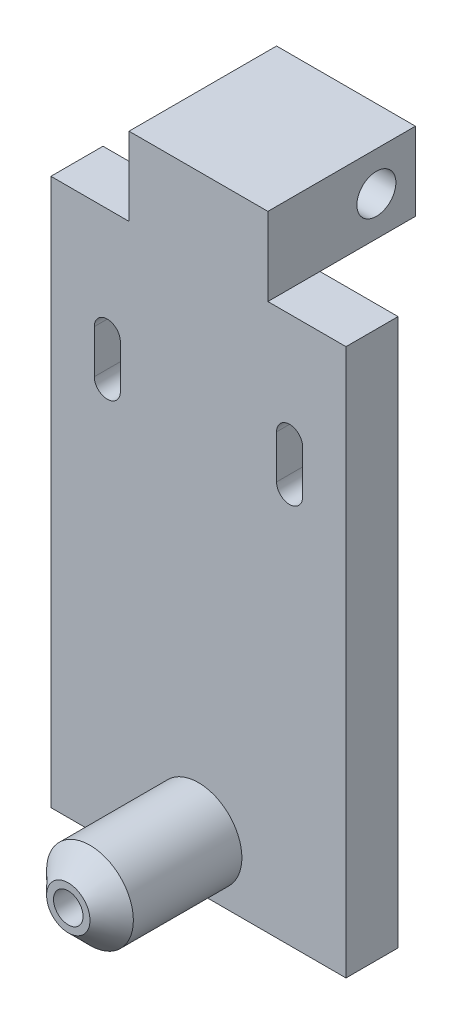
ISO-10303-21;
HEADER;
FILE_DESCRIPTION(('STEP AP214'),'2;1');
FILE_NAME('part.step','',(''),(''),'','','');
FILE_SCHEMA(('AUTOMOTIVE_DESIGN { 1 0 10303 214 1 1 1 1 }'));
ENDSEC;
DATA;
#1=APPLICATION_CONTEXT('core data for automotive mechanical design processes');
#2=APPLICATION_PROTOCOL_DEFINITION('international standard','automotive_design',2000,#1);
#3=PRODUCT_CONTEXT('',#1,'mechanical');
#4=PRODUCT('Part','Part','',(#3));
#5=PRODUCT_RELATED_PRODUCT_CATEGORY('part','',(#4));
#6=PRODUCT_DEFINITION_FORMATION('','',#4);
#7=PRODUCT_DEFINITION_CONTEXT('part definition',#1,'design');
#8=PRODUCT_DEFINITION('design','',#6,#7);
#9=PRODUCT_DEFINITION_SHAPE('','',#8);
#10=(LENGTH_UNIT() NAMED_UNIT(*) SI_UNIT(.MILLI.,.METRE.));
#11=(NAMED_UNIT(*) PLANE_ANGLE_UNIT() SI_UNIT($,.RADIAN.));
#12=(NAMED_UNIT(*) SI_UNIT($,.STERADIAN.) SOLID_ANGLE_UNIT());
#13=UNCERTAINTY_MEASURE_WITH_UNIT(LENGTH_MEASURE(1.E-05),#10,'distance_accuracy_value','');
#14=(GEOMETRIC_REPRESENTATION_CONTEXT(3) GLOBAL_UNCERTAINTY_ASSIGNED_CONTEXT((#13)) GLOBAL_UNIT_ASSIGNED_CONTEXT((#10,
#11,#12)) REPRESENTATION_CONTEXT('',''));
#15=CARTESIAN_POINT('',(0.,0.,0.));
#16=DIRECTION('',(0.,0.,1.));
#17=DIRECTION('',(1.,0.,0.));
#18=AXIS2_PLACEMENT_3D('',#15,#16,#17);
#19=CARTESIAN_POINT('',(0.,126.,12.));
#20=DIRECTION('',(0.,-1.,0.));
#21=DIRECTION('',(0.,0.,-1.));
#22=AXIS2_PLACEMENT_3D('',#19,#20,#21);
#23=PLANE('',#22);
#24=DIRECTION('',(0.,0.,1.));
#25=VECTOR('',#24,1.);
#26=CARTESIAN_POINT('',(18.,126.,12.));
#27=LINE('',#26,#25);
#28=CARTESIAN_POINT('',(18.,126.,0.));
#29=VERTEX_POINT('',#28);
#30=CARTESIAN_POINT('',(18.,126.,12.));
#31=VERTEX_POINT('',#30);
#32=EDGE_CURVE('E224',#29,#31,#27,.T.);
#33=ORIENTED_EDGE('',*,*,#32,.F.);
#34=DIRECTION('',(-1.,0.,0.));
#35=VECTOR('',#34,1.);
#36=CARTESIAN_POINT('',(0.,126.,0.));
#37=LINE('',#36,#35);
#38=CARTESIAN_POINT('',(0.,126.,0.));
#39=VERTEX_POINT('',#38);
#40=EDGE_CURVE('E329',#29,#39,#37,.T.);
#41=ORIENTED_EDGE('',*,*,#40,.T.);
#42=DIRECTION('',(0.,0.,-1.));
#43=VECTOR('',#42,1.);
#44=CARTESIAN_POINT('',(0.,126.,12.));
#45=LINE('',#44,#43);
#46=CARTESIAN_POINT('',(0.,126.,12.));
#47=VERTEX_POINT('',#46);
#48=EDGE_CURVE('E315',#47,#39,#45,.T.);
#49=ORIENTED_EDGE('',*,*,#48,.F.);
#50=DIRECTION('',(-1.,0.,0.));
#51=VECTOR('',#50,1.);
#52=CARTESIAN_POINT('',(0.,126.,12.));
#53=LINE('',#52,#51);
#54=EDGE_CURVE('E230',#31,#47,#53,.T.);
#55=ORIENTED_EDGE('',*,*,#54,.F.);
#56=EDGE_LOOP('',(#33,#41,#49,#55));
#57=FACE_BOUND('',#56,.T.);
#58=ADVANCED_FACE('F32',(#57),#23,.F.);
#59=DIRECTION('',(0.,0.,-1.));
#60=VECTOR('',#59,1.);
#61=CARTESIAN_POINT('',(50.,126.,12.));
#62=LINE('',#61,#60);
#63=CARTESIAN_POINT('',(50.,126.,12.));
#64=VERTEX_POINT('',#63);
#65=CARTESIAN_POINT('',(50.,126.,0.));
#66=VERTEX_POINT('',#65);
#67=EDGE_CURVE('E233',#64,#66,#62,.T.);
#68=ORIENTED_EDGE('',*,*,#67,.F.);
#69=CARTESIAN_POINT('',(68.,126.,12.));
#70=VERTEX_POINT('',#69);
#71=EDGE_CURVE('E336',#70,#64,#53,.T.);
#72=ORIENTED_EDGE('',*,*,#71,.F.);
#73=DIRECTION('',(0.,0.,-1.));
#74=VECTOR('',#73,1.);
#75=CARTESIAN_POINT('',(68.,126.,12.));
#76=LINE('',#75,#74);
#77=CARTESIAN_POINT('',(68.,126.,0.));
#78=VERTEX_POINT('',#77);
#79=EDGE_CURVE('E335',#70,#78,#76,.T.);
#80=ORIENTED_EDGE('',*,*,#79,.T.);
#81=EDGE_CURVE('E330',#78,#66,#37,.T.);
#82=ORIENTED_EDGE('',*,*,#81,.T.);
#83=EDGE_LOOP('',(#68,#72,#80,#82));
#84=FACE_BOUND('',#83,.T.);
#85=ADVANCED_FACE('F283',(#84),#23,.F.);
#86=CARTESIAN_POINT('',(0.,126.,12.));
#87=DIRECTION('',(0.,0.,-1.));
#88=DIRECTION('',(-1.,0.,0.));
#89=AXIS2_PLACEMENT_3D('',#86,#87,#88);
#90=PLANE('',#89);
#91=DIRECTION('',(0.,-1.,0.));
#92=VECTOR('',#91,1.);
#93=CARTESIAN_POINT('',(52.,101.,12.));
#94=LINE('',#93,#92);
#95=CARTESIAN_POINT('',(52.,101.,12.));
#96=VERTEX_POINT('',#95);
#97=CARTESIAN_POINT('',(52.,91.,12.));
#98=VERTEX_POINT('',#97);
#99=EDGE_CURVE('E165',#96,#98,#94,.T.);
#100=ORIENTED_EDGE('',*,*,#99,.F.);
#101=CARTESIAN_POINT('',(55.,101.,12.));
#102=DIRECTION('',(0.,0.,1.));
#103=DIRECTION('',(-1.,0.,0.));
#104=AXIS2_PLACEMENT_3D('',#101,#102,#103);
#105=CIRCLE('',#104,3.);
#106=CARTESIAN_POINT('',(58.,101.,12.));
#107=VERTEX_POINT('',#106);
#108=EDGE_CURVE('E47',#107,#96,#105,.T.);
#109=ORIENTED_EDGE('',*,*,#108,.F.);
#110=DIRECTION('',(0.,1.,0.));
#111=VECTOR('',#110,1.);
#112=CARTESIAN_POINT('',(58.,101.,12.));
#113=LINE('',#112,#111);
#114=CARTESIAN_POINT('',(58.,91.,12.));
#115=VERTEX_POINT('',#114);
#116=EDGE_CURVE('E172',#115,#107,#113,.T.);
#117=ORIENTED_EDGE('',*,*,#116,.F.);
#118=CARTESIAN_POINT('',(55.,91.,12.));
#119=DIRECTION('',(0.,0.,1.));
#120=DIRECTION('',(1.,0.,0.));
#121=AXIS2_PLACEMENT_3D('',#118,#119,#120);
#122=CIRCLE('',#121,3.);
#123=EDGE_CURVE('E156',#98,#115,#122,.T.);
#124=ORIENTED_EDGE('',*,*,#123,.F.);
#125=EDGE_LOOP('',(#100,#109,#117,#124));
#126=FACE_BOUND('',#125,.T.);
#127=DIRECTION('',(0.,-1.,0.));
#128=VECTOR('',#127,1.);
#129=CARTESIAN_POINT('',(10.,101.,12.));
#130=LINE('',#129,#128);
#131=CARTESIAN_POINT('',(10.,101.,12.));
#132=VERTEX_POINT('',#131);
#133=CARTESIAN_POINT('',(10.,91.,12.));
#134=VERTEX_POINT('',#133);
#135=EDGE_CURVE('E183',#132,#134,#130,.T.);
#136=ORIENTED_EDGE('',*,*,#135,.F.);
#137=CARTESIAN_POINT('',(13.,101.,12.));
#138=DIRECTION('',(0.,0.,1.));
#139=DIRECTION('',(-1.,0.,0.));
#140=AXIS2_PLACEMENT_3D('',#137,#138,#139);
#141=CIRCLE('',#140,3.);
#142=CARTESIAN_POINT('',(16.,101.,12.));
#143=VERTEX_POINT('',#142);
#144=EDGE_CURVE('E179',#143,#132,#141,.T.);
#145=ORIENTED_EDGE('',*,*,#144,.F.);
#146=DIRECTION('',(0.,1.,0.));
#147=VECTOR('',#146,1.);
#148=CARTESIAN_POINT('',(16.,101.,12.));
#149=LINE('',#148,#147);
#150=CARTESIAN_POINT('',(16.,91.,12.));
#151=VERTEX_POINT('',#150);
#152=EDGE_CURVE('E189',#151,#143,#149,.T.);
#153=ORIENTED_EDGE('',*,*,#152,.F.);
#154=CARTESIAN_POINT('',(13.,91.,12.));
#155=DIRECTION('',(0.,0.,1.));
#156=DIRECTION('',(1.,0.,0.));
#157=AXIS2_PLACEMENT_3D('',#154,#155,#156);
#158=CIRCLE('',#157,3.);
#159=EDGE_CURVE('E186',#134,#151,#158,.T.);
#160=ORIENTED_EDGE('',*,*,#159,.F.);
#161=EDGE_LOOP('',(#136,#145,#153,#160));
#162=FACE_BOUND('',#161,.T.);
#163=DIRECTION('',(0.,-1.,0.));
#164=VECTOR('',#163,1.);
#165=CARTESIAN_POINT('',(0.,0.,12.));
#166=LINE('',#165,#164);
#167=CARTESIAN_POINT('',(0.,0.,12.));
#168=VERTEX_POINT('',#167);
#169=EDGE_CURVE('E332',#47,#168,#166,.T.);
#170=ORIENTED_EDGE('',*,*,#169,.T.);
#171=DIRECTION('',(1.,0.,0.));
#172=VECTOR('',#171,1.);
#173=CARTESIAN_POINT('',(0.,0.,12.));
#174=LINE('',#173,#172);
#175=CARTESIAN_POINT('',(68.,0.,12.));
#176=VERTEX_POINT('',#175);
#177=EDGE_CURVE('E356',#168,#176,#174,.T.);
#178=ORIENTED_EDGE('',*,*,#177,.T.);
#179=DIRECTION('',(0.,1.,0.));
#180=VECTOR('',#179,1.);
#181=CARTESIAN_POINT('',(68.,0.,12.));
#182=LINE('',#181,#180);
#183=EDGE_CURVE('E354',#176,#70,#182,.T.);
#184=ORIENTED_EDGE('',*,*,#183,.T.);
#185=ORIENTED_EDGE('',*,*,#71,.T.);
#186=DIRECTION('',(0.,-1.,0.));
#187=VECTOR('',#186,1.);
#188=CARTESIAN_POINT('',(50.,144.,12.));
#189=LINE('',#188,#187);
#190=CARTESIAN_POINT('',(50.,144.,12.));
#191=VERTEX_POINT('',#190);
#192=EDGE_CURVE('E236',#191,#64,#189,.T.);
#193=ORIENTED_EDGE('',*,*,#192,.F.);
#194=DIRECTION('',(1.,0.,0.));
#195=VECTOR('',#194,1.);
#196=CARTESIAN_POINT('',(18.,144.,12.));
#197=LINE('',#196,#195);
#198=CARTESIAN_POINT('',(18.,144.,12.));
#199=VERTEX_POINT('',#198);
#200=EDGE_CURVE('E208',#199,#191,#197,.T.);
#201=ORIENTED_EDGE('',*,*,#200,.F.);
#202=DIRECTION('',(0.,-1.,0.));
#203=VECTOR('',#202,1.);
#204=CARTESIAN_POINT('',(18.,144.,12.));
#205=LINE('',#204,#203);
#206=EDGE_CURVE('E239',#199,#31,#205,.T.);
#207=ORIENTED_EDGE('',*,*,#206,.T.);
#208=ORIENTED_EDGE('',*,*,#54,.T.);
#209=EDGE_LOOP('',(#170,#178,#184,#185,#193,#201,#207,#208));
#210=FACE_BOUND('',#209,.T.);
#211=CARTESIAN_POINT('',(34.,12.,12.));
#212=DIRECTION('',(0.,0.,-1.));
#213=DIRECTION('',(-1.,0.,0.));
#214=AXIS2_PLACEMENT_3D('',#211,#212,#213);
#215=CIRCLE('',#214,10.);
#216=CARTESIAN_POINT('',(24.,12.,12.));
#217=VERTEX_POINT('',#216);
#218=EDGE_CURVE('E343',#217,#217,#215,.F.);
#219=ORIENTED_EDGE('',*,*,#218,.F.);
#220=EDGE_LOOP('',(#219));
#221=FACE_BOUND('',#220,.T.);
#222=ADVANCED_FACE('F169',(#126,#162,#210,#221),#90,.F.);
#223=CARTESIAN_POINT('',(0.,0.,12.));
#224=DIRECTION('',(1.,0.,0.));
#225=DIRECTION('',(0.,0.,-1.));
#226=AXIS2_PLACEMENT_3D('',#223,#224,#225);
#227=PLANE('',#226);
#228=DIRECTION('',(0.,-1.,0.));
#229=VECTOR('',#228,1.);
#230=CARTESIAN_POINT('',(0.,0.,0.));
#231=LINE('',#230,#229);
#232=CARTESIAN_POINT('',(0.,0.,0.));
#233=VERTEX_POINT('',#232);
#234=EDGE_CURVE('E310',#39,#233,#231,.T.);
#235=ORIENTED_EDGE('',*,*,#234,.T.);
#236=DIRECTION('',(0.,0.,-1.));
#237=VECTOR('',#236,1.);
#238=CARTESIAN_POINT('',(0.,0.,12.));
#239=LINE('',#238,#237);
#240=EDGE_CURVE('E313',#168,#233,#239,.T.);
#241=ORIENTED_EDGE('',*,*,#240,.F.);
#242=ORIENTED_EDGE('',*,*,#169,.F.);
#243=ORIENTED_EDGE('',*,*,#48,.T.);
#244=EDGE_LOOP('',(#235,#241,#242,#243));
#245=FACE_BOUND('',#244,.T.);
#246=ADVANCED_FACE('F299',(#245),#227,.F.);
#247=CARTESIAN_POINT('',(0.,0.,12.));
#248=DIRECTION('',(0.,1.,0.));
#249=DIRECTION('',(0.,0.,1.));
#250=AXIS2_PLACEMENT_3D('',#247,#248,#249);
#251=PLANE('',#250);
#252=DIRECTION('',(1.,0.,0.));
#253=VECTOR('',#252,1.);
#254=CARTESIAN_POINT('',(0.,0.,0.));
#255=LINE('',#254,#253);
#256=CARTESIAN_POINT('',(68.,0.,0.));
#257=VERTEX_POINT('',#256);
#258=EDGE_CURVE('E318',#233,#257,#255,.T.);
#259=ORIENTED_EDGE('',*,*,#258,.T.);
#260=DIRECTION('',(0.,0.,-1.));
#261=VECTOR('',#260,1.);
#262=CARTESIAN_POINT('',(68.,0.,12.));
#263=LINE('',#262,#261);
#264=EDGE_CURVE('E339',#176,#257,#263,.T.);
#265=ORIENTED_EDGE('',*,*,#264,.F.);
#266=ORIENTED_EDGE('',*,*,#177,.F.);
#267=ORIENTED_EDGE('',*,*,#240,.T.);
#268=EDGE_LOOP('',(#259,#265,#266,#267));
#269=FACE_BOUND('',#268,.T.);
#270=ADVANCED_FACE('F296',(#269),#251,.F.);
#271=CARTESIAN_POINT('',(68.,0.,12.));
#272=DIRECTION('',(-1.,0.,0.));
#273=DIRECTION('',(0.,0.,1.));
#274=AXIS2_PLACEMENT_3D('',#271,#272,#273);
#275=PLANE('',#274);
#276=DIRECTION('',(0.,1.,0.));
#277=VECTOR('',#276,1.);
#278=CARTESIAN_POINT('',(68.,0.,0.));
#279=LINE('',#278,#277);
#280=EDGE_CURVE('E321',#257,#78,#279,.T.);
#281=ORIENTED_EDGE('',*,*,#280,.T.);
#282=ORIENTED_EDGE('',*,*,#79,.F.);
#283=ORIENTED_EDGE('',*,*,#183,.F.);
#284=ORIENTED_EDGE('',*,*,#264,.T.);
#285=EDGE_LOOP('',(#281,#282,#283,#284));
#286=FACE_BOUND('',#285,.T.);
#287=ADVANCED_FACE('F293',(#286),#275,.F.);
#288=CARTESIAN_POINT('',(0.,126.,0.));
#289=DIRECTION('',(0.,0.,-1.));
#290=DIRECTION('',(-1.,0.,0.));
#291=AXIS2_PLACEMENT_3D('',#288,#289,#290);
#292=PLANE('',#291);
#293=CARTESIAN_POINT('',(55.,101.,0.));
#294=DIRECTION('',(0.,0.,-1.));
#295=DIRECTION('',(-1.,0.,0.));
#296=AXIS2_PLACEMENT_3D('',#293,#294,#295);
#297=CIRCLE('',#296,3.);
#298=CARTESIAN_POINT('',(52.,101.,0.));
#299=VERTEX_POINT('',#298);
#300=CARTESIAN_POINT('',(58.,101.,0.));
#301=VERTEX_POINT('',#300);
#302=EDGE_CURVE('E11',#299,#301,#297,.T.);
#303=ORIENTED_EDGE('',*,*,#302,.F.);
#304=DIRECTION('',(0.,1.,0.));
#305=VECTOR('',#304,1.);
#306=CARTESIAN_POINT('',(52.,126.,0.));
#307=LINE('',#306,#305);
#308=CARTESIAN_POINT('',(52.,91.,0.));
#309=VERTEX_POINT('',#308);
#310=EDGE_CURVE('E258',#309,#299,#307,.T.);
#311=ORIENTED_EDGE('',*,*,#310,.F.);
#312=CARTESIAN_POINT('',(55.,91.,0.));
#313=DIRECTION('',(0.,0.,-1.));
#314=DIRECTION('',(-1.,0.,0.));
#315=AXIS2_PLACEMENT_3D('',#312,#313,#314);
#316=CIRCLE('',#315,3.);
#317=CARTESIAN_POINT('',(58.,91.,0.));
#318=VERTEX_POINT('',#317);
#319=EDGE_CURVE('E159',#318,#309,#316,.T.);
#320=ORIENTED_EDGE('',*,*,#319,.F.);
#321=DIRECTION('',(0.,-1.,0.));
#322=VECTOR('',#321,1.);
#323=CARTESIAN_POINT('',(58.,126.,0.));
#324=LINE('',#323,#322);
#325=EDGE_CURVE('E40',#301,#318,#324,.T.);
#326=ORIENTED_EDGE('',*,*,#325,.F.);
#327=EDGE_LOOP('',(#303,#311,#320,#326));
#328=FACE_BOUND('',#327,.T.);
#329=CARTESIAN_POINT('',(13.,101.,0.));
#330=DIRECTION('',(0.,0.,-1.));
#331=DIRECTION('',(-1.,0.,0.));
#332=AXIS2_PLACEMENT_3D('',#329,#330,#331);
#333=CIRCLE('',#332,3.);
#334=CARTESIAN_POINT('',(10.,101.,0.));
#335=VERTEX_POINT('',#334);
#336=CARTESIAN_POINT('',(16.,101.,0.));
#337=VERTEX_POINT('',#336);
#338=EDGE_CURVE('E256',#335,#337,#333,.T.);
#339=ORIENTED_EDGE('',*,*,#338,.F.);
#340=DIRECTION('',(0.,1.,0.));
#341=VECTOR('',#340,1.);
#342=CARTESIAN_POINT('',(9.99999999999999,126.,0.));
#343=LINE('',#342,#341);
#344=CARTESIAN_POINT('',(10.,91.,0.));
#345=VERTEX_POINT('',#344);
#346=EDGE_CURVE('E228',#345,#335,#343,.T.);
#347=ORIENTED_EDGE('',*,*,#346,.F.);
#348=CARTESIAN_POINT('',(13.,91.,0.));
#349=DIRECTION('',(0.,0.,-1.));
#350=DIRECTION('',(-1.,0.,0.));
#351=AXIS2_PLACEMENT_3D('',#348,#349,#350);
#352=CIRCLE('',#351,3.);
#353=CARTESIAN_POINT('',(16.,91.,0.));
#354=VERTEX_POINT('',#353);
#355=EDGE_CURVE('E251',#354,#345,#352,.T.);
#356=ORIENTED_EDGE('',*,*,#355,.F.);
#357=DIRECTION('',(0.,-1.,0.));
#358=VECTOR('',#357,1.);
#359=CARTESIAN_POINT('',(16.,126.,0.));
#360=LINE('',#359,#358);
#361=EDGE_CURVE('E254',#337,#354,#360,.T.);
#362=ORIENTED_EDGE('',*,*,#361,.F.);
#363=EDGE_LOOP('',(#339,#347,#356,#362));
#364=FACE_BOUND('',#363,.T.);
#365=ORIENTED_EDGE('',*,*,#234,.F.);
#366=ORIENTED_EDGE('',*,*,#40,.F.);
#367=EDGE_CURVE('E333',#66,#29,#37,.T.);
#368=ORIENTED_EDGE('',*,*,#367,.F.);
#369=ORIENTED_EDGE('',*,*,#81,.F.);
#370=ORIENTED_EDGE('',*,*,#280,.F.);
#371=ORIENTED_EDGE('',*,*,#258,.F.);
#372=EDGE_LOOP('',(#365,#366,#368,#369,#370,#371));
#373=FACE_BOUND('',#372,.T.);
#374=ADVANCED_FACE('F266',(#328,#364,#373),#292,.T.);
#375=CARTESIAN_POINT('',(34.,12.,42.));
#376=DIRECTION('',(0.,0.,-1.));
#377=DIRECTION('',(-1.,0.,0.));
#378=AXIS2_PLACEMENT_3D('',#375,#376,#377);
#379=CYLINDRICAL_SURFACE('',#378,10.);
#380=CARTESIAN_POINT('',(34.,12.,37.));
#381=DIRECTION('',(0.,0.,1.));
#382=DIRECTION('',(1.,0.,0.));
#383=AXIS2_PLACEMENT_3D('',#380,#381,#382);
#384=CIRCLE('',#383,10.);
#385=CARTESIAN_POINT('',(44.,12.,37.));
#386=VERTEX_POINT('',#385);
#387=EDGE_CURVE('E229',#386,#386,#384,.F.);
#388=ORIENTED_EDGE('',*,*,#387,.T.);
#389=EDGE_LOOP('',(#388));
#390=FACE_BOUND('',#389,.T.);
#391=ORIENTED_EDGE('',*,*,#218,.T.);
#392=EDGE_LOOP('',(#391));
#393=FACE_BOUND('',#392,.T.);
#394=ADVANCED_FACE('F385',(#390,#393),#379,.T.);
#395=CARTESIAN_POINT('',(34.,12.,42.));
#396=DIRECTION('',(0.,0.,1.));
#397=DIRECTION('',(1.,0.,0.));
#398=AXIS2_PLACEMENT_3D('',#395,#396,#397);
#399=PLANE('',#398);
#400=CARTESIAN_POINT('',(34.,12.,42.));
#401=DIRECTION('',(0.,0.,1.));
#402=DIRECTION('',(1.,0.,0.));
#403=AXIS2_PLACEMENT_3D('',#400,#401,#402);
#404=CIRCLE('',#403,3.4);
#405=CARTESIAN_POINT('',(37.4,12.,42.));
#406=VERTEX_POINT('',#405);
#407=EDGE_CURVE('E319',#406,#406,#404,.T.);
#408=ORIENTED_EDGE('',*,*,#407,.F.);
#409=EDGE_LOOP('',(#408));
#410=FACE_BOUND('',#409,.T.);
#411=CARTESIAN_POINT('',(34.,12.,42.));
#412=DIRECTION('',(0.,0.,1.));
#413=DIRECTION('',(1.,0.,0.));
#414=AXIS2_PLACEMENT_3D('',#411,#412,#413);
#415=CIRCLE('',#414,4.99999999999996);
#416=CARTESIAN_POINT('',(39.,12.,42.));
#417=VERTEX_POINT('',#416);
#418=EDGE_CURVE('E346',#417,#417,#415,.T.);
#419=ORIENTED_EDGE('',*,*,#418,.T.);
#420=EDGE_LOOP('',(#419));
#421=FACE_BOUND('',#420,.T.);
#422=ADVANCED_FACE('F389',(#410,#421),#399,.T.);
#423=CARTESIAN_POINT('',(34.,12.,42.));
#424=DIRECTION('',(0.,0.,-1.));
#425=DIRECTION('',(-1.,0.,0.));
#426=AXIS2_PLACEMENT_3D('',#423,#424,#425);
#427=CONICAL_SURFACE('',#426,4.99999999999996,0.785398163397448);
#428=ORIENTED_EDGE('',*,*,#387,.F.);
#429=EDGE_LOOP('',(#428));
#430=FACE_BOUND('',#429,.T.);
#431=ORIENTED_EDGE('',*,*,#418,.F.);
#432=EDGE_LOOP('',(#431));
#433=FACE_BOUND('',#432,.T.);
#434=ADVANCED_FACE('F34',(#430,#433),#427,.T.);
#435=CARTESIAN_POINT('',(34.,12.,42.));
#436=DIRECTION('',(0.,0.,1.));
#437=DIRECTION('',(1.,0.,0.));
#438=AXIS2_PLACEMENT_3D('',#435,#436,#437);
#439=CYLINDRICAL_SURFACE('',#438,3.4);
#440=CARTESIAN_POINT('',(34.,12.,18.));
#441=DIRECTION('',(0.,0.,1.));
#442=DIRECTION('',(1.,0.,0.));
#443=AXIS2_PLACEMENT_3D('',#440,#441,#442);
#444=CIRCLE('',#443,3.39999999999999);
#445=CARTESIAN_POINT('',(37.4,12.,18.));
#446=VERTEX_POINT('',#445);
#447=EDGE_CURVE('E245',#446,#446,#444,.T.);
#448=ORIENTED_EDGE('',*,*,#447,.F.);
#449=EDGE_LOOP('',(#448));
#450=FACE_BOUND('',#449,.T.);
#451=ORIENTED_EDGE('',*,*,#407,.T.);
#452=EDGE_LOOP('',(#451));
#453=FACE_BOUND('',#452,.T.);
#454=ADVANCED_FACE('F399',(#450,#453),#439,.F.);
#455=CARTESIAN_POINT('',(34.,12.,18.));
#456=DIRECTION('',(0.,0.,1.));
#457=DIRECTION('',(1.,0.,0.));
#458=AXIS2_PLACEMENT_3D('',#455,#456,#457);
#459=CONICAL_SURFACE('',#458,3.39999999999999,1.02974425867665);
#460=CARTESIAN_POINT('',(34.,12.,15.9570738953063));
#461=VERTEX_POINT('',#460);
#462=VERTEX_LOOP('',#461);
#463=FACE_BOUND('',#462,.T.);
#464=ORIENTED_EDGE('',*,*,#447,.T.);
#465=EDGE_LOOP('',(#464));
#466=FACE_BOUND('',#465,.T.);
#467=ADVANCED_FACE('F402',(#463,#466),#459,.F.);
#468=CARTESIAN_POINT('',(18.,144.,12.));
#469=DIRECTION('',(1.,0.,0.));
#470=DIRECTION('',(0.,0.,-1.));
#471=AXIS2_PLACEMENT_3D('',#468,#469,#470);
#472=PLANE('',#471);
#473=CARTESIAN_POINT('',(18.,135.,-13.));
#474=DIRECTION('',(-1.,0.,0.));
#475=DIRECTION('',(0.,0.,1.));
#476=AXIS2_PLACEMENT_3D('',#473,#474,#475);
#477=CIRCLE('',#476,4.5);
#478=CARTESIAN_POINT('',(18.,135.,-8.5));
#479=VERTEX_POINT('',#478);
#480=EDGE_CURVE('E195',#479,#479,#477,.T.);
#481=ORIENTED_EDGE('',*,*,#480,.F.);
#482=EDGE_LOOP('',(#481));
#483=FACE_BOUND('',#482,.T.);
#484=CARTESIAN_POINT('',(18.,126.,-22.));
#485=VERTEX_POINT('',#484);
#486=EDGE_CURVE('E216',#485,#29,#27,.T.);
#487=ORIENTED_EDGE('',*,*,#486,.T.);
#488=ORIENTED_EDGE('',*,*,#32,.T.);
#489=ORIENTED_EDGE('',*,*,#206,.F.);
#490=DIRECTION('',(0.,0.,1.));
#491=VECTOR('',#490,1.);
#492=CARTESIAN_POINT('',(18.,144.,12.));
#493=LINE('',#492,#491);
#494=CARTESIAN_POINT('',(18.,144.,-22.));
#495=VERTEX_POINT('',#494);
#496=EDGE_CURVE('E205',#495,#199,#493,.T.);
#497=ORIENTED_EDGE('',*,*,#496,.F.);
#498=DIRECTION('',(0.,-1.,0.));
#499=VECTOR('',#498,1.);
#500=CARTESIAN_POINT('',(18.,144.,-22.));
#501=LINE('',#500,#499);
#502=EDGE_CURVE('E215',#495,#485,#501,.T.);
#503=ORIENTED_EDGE('',*,*,#502,.T.);
#504=EDGE_LOOP('',(#487,#488,#489,#497,#503));
#505=FACE_BOUND('',#504,.T.);
#506=ADVANCED_FACE('F378',(#483,#505),#472,.F.);
#507=CARTESIAN_POINT('',(50.,144.,12.));
#508=DIRECTION('',(-1.,0.,0.));
#509=DIRECTION('',(0.,0.,1.));
#510=AXIS2_PLACEMENT_3D('',#507,#508,#509);
#511=PLANE('',#510);
#512=CARTESIAN_POINT('',(50.,135.,-13.));
#513=DIRECTION('',(-1.,0.,0.));
#514=DIRECTION('',(0.,0.,1.));
#515=AXIS2_PLACEMENT_3D('',#512,#513,#514);
#516=CIRCLE('',#515,4.5);
#517=CARTESIAN_POINT('',(50.,135.,-8.5));
#518=VERTEX_POINT('',#517);
#519=EDGE_CURVE('E204',#518,#518,#516,.T.);
#520=ORIENTED_EDGE('',*,*,#519,.T.);
#521=EDGE_LOOP('',(#520));
#522=FACE_BOUND('',#521,.T.);
#523=ORIENTED_EDGE('',*,*,#67,.T.);
#524=CARTESIAN_POINT('',(50.,126.,-22.));
#525=VERTEX_POINT('',#524);
#526=EDGE_CURVE('E220',#66,#525,#62,.T.);
#527=ORIENTED_EDGE('',*,*,#526,.T.);
#528=DIRECTION('',(0.,-1.,0.));
#529=VECTOR('',#528,1.);
#530=CARTESIAN_POINT('',(50.,144.,-22.));
#531=LINE('',#530,#529);
#532=CARTESIAN_POINT('',(50.,144.,-22.));
#533=VERTEX_POINT('',#532);
#534=EDGE_CURVE('E240',#533,#525,#531,.T.);
#535=ORIENTED_EDGE('',*,*,#534,.F.);
#536=DIRECTION('',(0.,0.,-1.));
#537=VECTOR('',#536,1.);
#538=CARTESIAN_POINT('',(50.,144.,12.));
#539=LINE('',#538,#537);
#540=EDGE_CURVE('E211',#191,#533,#539,.T.);
#541=ORIENTED_EDGE('',*,*,#540,.F.);
#542=ORIENTED_EDGE('',*,*,#192,.T.);
#543=EDGE_LOOP('',(#523,#527,#535,#541,#542));
#544=FACE_BOUND('',#543,.T.);
#545=ADVANCED_FACE('F409',(#522,#544),#511,.F.);
#546=CARTESIAN_POINT('',(18.,144.,-22.));
#547=DIRECTION('',(0.,0.,1.));
#548=DIRECTION('',(1.,0.,0.));
#549=AXIS2_PLACEMENT_3D('',#546,#547,#548);
#550=PLANE('',#549);
#551=DIRECTION('',(-1.,0.,0.));
#552=VECTOR('',#551,1.);
#553=CARTESIAN_POINT('',(18.,126.,-22.));
#554=LINE('',#553,#552);
#555=EDGE_CURVE('E209',#525,#485,#554,.T.);
#556=ORIENTED_EDGE('',*,*,#555,.T.);
#557=ORIENTED_EDGE('',*,*,#502,.F.);
#558=DIRECTION('',(-1.,0.,0.));
#559=VECTOR('',#558,1.);
#560=CARTESIAN_POINT('',(18.,144.,-22.));
#561=LINE('',#560,#559);
#562=EDGE_CURVE('E213',#533,#495,#561,.T.);
#563=ORIENTED_EDGE('',*,*,#562,.F.);
#564=ORIENTED_EDGE('',*,*,#534,.T.);
#565=EDGE_LOOP('',(#556,#557,#563,#564));
#566=FACE_BOUND('',#565,.T.);
#567=ADVANCED_FACE('F370',(#566),#550,.F.);
#568=CARTESIAN_POINT('',(18.,144.,-22.));
#569=DIRECTION('',(0.,-1.,0.));
#570=DIRECTION('',(0.,0.,-1.));
#571=AXIS2_PLACEMENT_3D('',#568,#569,#570);
#572=PLANE('',#571);
#573=ORIENTED_EDGE('',*,*,#496,.T.);
#574=ORIENTED_EDGE('',*,*,#200,.T.);
#575=ORIENTED_EDGE('',*,*,#540,.T.);
#576=ORIENTED_EDGE('',*,*,#562,.T.);
#577=EDGE_LOOP('',(#573,#574,#575,#576));
#578=FACE_BOUND('',#577,.T.);
#579=ADVANCED_FACE('F416',(#578),#572,.F.);
#580=CARTESIAN_POINT('',(18.,126.,-22.));
#581=DIRECTION('',(0.,-1.,0.));
#582=DIRECTION('',(0.,0.,-1.));
#583=AXIS2_PLACEMENT_3D('',#580,#581,#582);
#584=PLANE('',#583);
#585=ORIENTED_EDGE('',*,*,#526,.F.);
#586=ORIENTED_EDGE('',*,*,#367,.T.);
#587=ORIENTED_EDGE('',*,*,#486,.F.);
#588=ORIENTED_EDGE('',*,*,#555,.F.);
#589=EDGE_LOOP('',(#585,#586,#587,#588));
#590=FACE_BOUND('',#589,.T.);
#591=ADVANCED_FACE('F381',(#590),#584,.T.);
#592=CARTESIAN_POINT('',(68.000025,135.,-13.));
#593=DIRECTION('',(-1.,0.,0.));
#594=DIRECTION('',(0.,0.,1.));
#595=AXIS2_PLACEMENT_3D('',#592,#593,#594);
#596=CYLINDRICAL_SURFACE('',#595,4.5);
#597=ORIENTED_EDGE('',*,*,#480,.T.);
#598=EDGE_LOOP('',(#597));
#599=FACE_BOUND('',#598,.T.);
#600=ORIENTED_EDGE('',*,*,#519,.F.);
#601=EDGE_LOOP('',(#600));
#602=FACE_BOUND('',#601,.T.);
#603=ADVANCED_FACE('F419',(#599,#602),#596,.F.);
#604=CARTESIAN_POINT('',(13.,101.,-22.));
#605=DIRECTION('',(0.,0.,1.));
#606=DIRECTION('',(1.,0.,0.));
#607=AXIS2_PLACEMENT_3D('',#604,#605,#606);
#608=CYLINDRICAL_SURFACE('',#607,3.);
#609=ORIENTED_EDGE('',*,*,#338,.T.);
#610=DIRECTION('',(0.,0.,1.));
#611=VECTOR('',#610,1.);
#612=CARTESIAN_POINT('',(16.,101.,-22.));
#613=LINE('',#612,#611);
#614=EDGE_CURVE('E193',#337,#143,#613,.T.);
#615=ORIENTED_EDGE('',*,*,#614,.T.);
#616=ORIENTED_EDGE('',*,*,#144,.T.);
#617=DIRECTION('',(0.,0.,1.));
#618=VECTOR('',#617,1.);
#619=CARTESIAN_POINT('',(10.,101.,-22.));
#620=LINE('',#619,#618);
#621=EDGE_CURVE('E192',#335,#132,#620,.T.);
#622=ORIENTED_EDGE('',*,*,#621,.F.);
#623=EDGE_LOOP('',(#609,#615,#616,#622));
#624=FACE_BOUND('',#623,.T.);
#625=ADVANCED_FACE('F425',(#624),#608,.F.);
#626=CARTESIAN_POINT('',(16.,101.,-22.));
#627=DIRECTION('',(1.,0.,0.));
#628=DIRECTION('',(0.,0.,-1.));
#629=AXIS2_PLACEMENT_3D('',#626,#627,#628);
#630=PLANE('',#629);
#631=ORIENTED_EDGE('',*,*,#361,.T.);
#632=DIRECTION('',(0.,0.,1.));
#633=VECTOR('',#632,1.);
#634=CARTESIAN_POINT('',(16.,91.,-22.));
#635=LINE('',#634,#633);
#636=EDGE_CURVE('E196',#354,#151,#635,.T.);
#637=ORIENTED_EDGE('',*,*,#636,.T.);
#638=ORIENTED_EDGE('',*,*,#152,.T.);
#639=ORIENTED_EDGE('',*,*,#614,.F.);
#640=EDGE_LOOP('',(#631,#637,#638,#639));
#641=FACE_BOUND('',#640,.T.);
#642=ADVANCED_FACE('F428',(#641),#630,.F.);
#643=CARTESIAN_POINT('',(13.,91.,-22.));
#644=DIRECTION('',(0.,0.,1.));
#645=DIRECTION('',(1.,0.,0.));
#646=AXIS2_PLACEMENT_3D('',#643,#644,#645);
#647=CYLINDRICAL_SURFACE('',#646,3.);
#648=ORIENTED_EDGE('',*,*,#355,.T.);
#649=DIRECTION('',(0.,0.,1.));
#650=VECTOR('',#649,1.);
#651=CARTESIAN_POINT('',(10.,91.,-22.));
#652=LINE('',#651,#650);
#653=EDGE_CURVE('E198',#345,#134,#652,.T.);
#654=ORIENTED_EDGE('',*,*,#653,.T.);
#655=ORIENTED_EDGE('',*,*,#159,.T.);
#656=ORIENTED_EDGE('',*,*,#636,.F.);
#657=EDGE_LOOP('',(#648,#654,#655,#656));
#658=FACE_BOUND('',#657,.T.);
#659=ADVANCED_FACE('F277',(#658),#647,.F.);
#660=CARTESIAN_POINT('',(10.,101.,-22.));
#661=DIRECTION('',(-1.,0.,0.));
#662=DIRECTION('',(0.,-1.,0.));
#663=AXIS2_PLACEMENT_3D('',#660,#661,#662);
#664=PLANE('',#663);
#665=ORIENTED_EDGE('',*,*,#346,.T.);
#666=ORIENTED_EDGE('',*,*,#621,.T.);
#667=ORIENTED_EDGE('',*,*,#135,.T.);
#668=ORIENTED_EDGE('',*,*,#653,.F.);
#669=EDGE_LOOP('',(#665,#666,#667,#668));
#670=FACE_BOUND('',#669,.T.);
#671=ADVANCED_FACE('F270',(#670),#664,.F.);
#672=CARTESIAN_POINT('',(55.,101.,-22.));
#673=DIRECTION('',(0.,0.,1.));
#674=DIRECTION('',(1.,0.,0.));
#675=AXIS2_PLACEMENT_3D('',#672,#673,#674);
#676=CYLINDRICAL_SURFACE('',#675,3.);
#677=ORIENTED_EDGE('',*,*,#302,.T.);
#678=DIRECTION('',(0.,0.,1.));
#679=VECTOR('',#678,1.);
#680=CARTESIAN_POINT('',(58.,101.,-22.));
#681=LINE('',#680,#679);
#682=EDGE_CURVE('E177',#301,#107,#681,.T.);
#683=ORIENTED_EDGE('',*,*,#682,.T.);
#684=ORIENTED_EDGE('',*,*,#108,.T.);
#685=DIRECTION('',(0.,0.,1.));
#686=VECTOR('',#685,1.);
#687=CARTESIAN_POINT('',(52.,101.,-22.));
#688=LINE('',#687,#686);
#689=EDGE_CURVE('E162',#299,#96,#688,.T.);
#690=ORIENTED_EDGE('',*,*,#689,.F.);
#691=EDGE_LOOP('',(#677,#683,#684,#690));
#692=FACE_BOUND('',#691,.T.);
#693=ADVANCED_FACE('F268',(#692),#676,.F.);
#694=CARTESIAN_POINT('',(58.,101.,-22.));
#695=DIRECTION('',(1.,0.,0.));
#696=DIRECTION('',(0.,1.,0.));
#697=AXIS2_PLACEMENT_3D('',#694,#695,#696);
#698=PLANE('',#697);
#699=ORIENTED_EDGE('',*,*,#325,.T.);
#700=DIRECTION('',(0.,0.,1.));
#701=VECTOR('',#700,1.);
#702=CARTESIAN_POINT('',(58.,91.,-22.));
#703=LINE('',#702,#701);
#704=EDGE_CURVE('E161',#318,#115,#703,.T.);
#705=ORIENTED_EDGE('',*,*,#704,.T.);
#706=ORIENTED_EDGE('',*,*,#116,.T.);
#707=ORIENTED_EDGE('',*,*,#682,.F.);
#708=EDGE_LOOP('',(#699,#705,#706,#707));
#709=FACE_BOUND('',#708,.T.);
#710=ADVANCED_FACE('F263',(#709),#698,.F.);
#711=CARTESIAN_POINT('',(55.,91.,-22.));
#712=DIRECTION('',(0.,0.,1.));
#713=DIRECTION('',(1.,0.,0.));
#714=AXIS2_PLACEMENT_3D('',#711,#712,#713);
#715=CYLINDRICAL_SURFACE('',#714,3.);
#716=ORIENTED_EDGE('',*,*,#319,.T.);
#717=DIRECTION('',(0.,0.,1.));
#718=VECTOR('',#717,1.);
#719=CARTESIAN_POINT('',(52.,91.,-22.));
#720=LINE('',#719,#718);
#721=EDGE_CURVE('E55',#309,#98,#720,.T.);
#722=ORIENTED_EDGE('',*,*,#721,.T.);
#723=ORIENTED_EDGE('',*,*,#123,.T.);
#724=ORIENTED_EDGE('',*,*,#704,.F.);
#725=EDGE_LOOP('',(#716,#722,#723,#724));
#726=FACE_BOUND('',#725,.T.);
#727=ADVANCED_FACE('F153',(#726),#715,.F.);
#728=CARTESIAN_POINT('',(52.,101.,-22.));
#729=DIRECTION('',(-1.,0.,0.));
#730=DIRECTION('',(0.,0.,1.));
#731=AXIS2_PLACEMENT_3D('',#728,#729,#730);
#732=PLANE('',#731);
#733=ORIENTED_EDGE('',*,*,#310,.T.);
#734=ORIENTED_EDGE('',*,*,#689,.T.);
#735=ORIENTED_EDGE('',*,*,#99,.T.);
#736=ORIENTED_EDGE('',*,*,#721,.F.);
#737=EDGE_LOOP('',(#733,#734,#735,#736));
#738=FACE_BOUND('',#737,.T.);
#739=ADVANCED_FACE('F166',(#738),#732,.F.);
#740=CLOSED_SHELL('',(#58,#85,#222,#246,#270,#287,#374,#394,#422,#434,#454,#467,#506,#545,#567,
#579,#591,#603,#625,#642,#659,#671,#693,#710,#727,#739));
#741=MANIFOLD_SOLID_BREP('B2',#740);
#742=ADVANCED_BREP_SHAPE_REPRESENTATION('',(#18,#741),#14);
#743=SHAPE_DEFINITION_REPRESENTATION(#9,#742);
ENDSEC;
END-ISO-10303-21;
